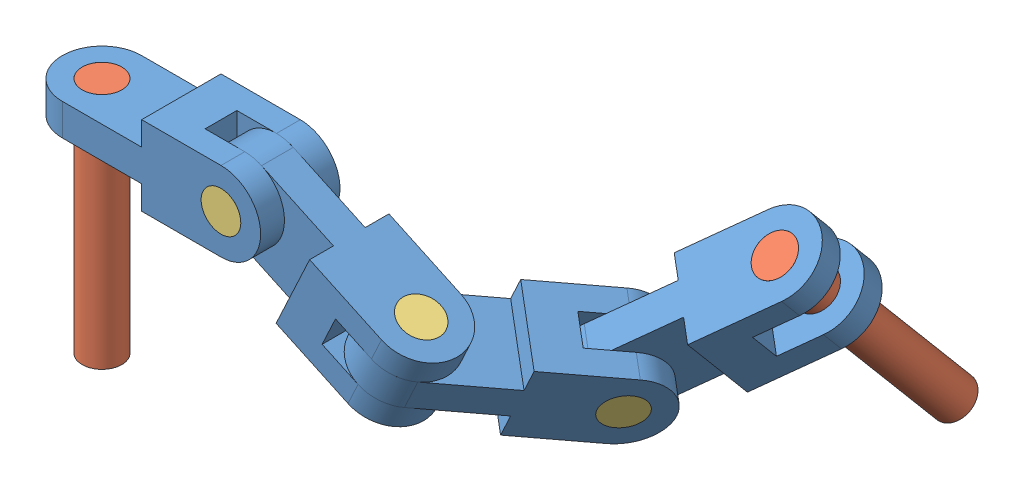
SolidWorks assembly Assemblage 1.SLDASM, configuration Default (file format 14000). Lengths in mm.
Overall size (743.15 346.45 520.78).
9 component instances, 3 part files, 22 mates.
Components (placement in the parent):
- chain_link-1: chain_link.SLDPRT [Default] at (551.0178 -99.1586 -216.4845) x (0.742404 -0.346189 0.573576) z (-0.126564 0.768256 0.627507) size (100 300 100)
- long_pin-1: long_pin.SLDPRT [Default] at origin size (50 300 50)
- short_pin-1: short_pin.SLDPRT [Default] at (200 -20 -50) x (1 0 0) z (0 1 0) size (50 100 50)
- chain_link-2: chain_link.SLDPRT [Default] at (100 -20 0) x (0 -1 0) z (0 0 1) size (100 300 100)
- chain_link-3: chain_link.SLDPRT [Default] at (290.6308 -62.2618 0) x (0 0 1) z (0.422618 0.906308 0) size (100 300 100)
- chain_link-4: chain_link.SLDPRT [Default] at (433.2452 -128.764 -81.9152) x (-0.422618 -0.906308 0) z (0.742404 -0.346189 0.573576) size (100 300 100)
- short_pin-2: short_pin.SLDPRT [Default] at (360.1306 -149.839 0) x (-0.491712 0.229289 -0.840027) z (-0.761323 0.355011 0.542544) size (50 100 50)
- short_pin-3: short_pin.SLDPRT [Default] at (448.1087 -135.695 -192.5092) x (-0.216703 0.686032 0.69455) z (-0.633937 -0.639932 0.434293) size (50 100 50)
- long_pin-2: long_pin.SLDPRT [Default] at (648.4478 -237.3768 -426.0153) x (0.958216 -0.068903 0.277624) z (0.256523 0.636424 -0.727434) size (50 300 50)
Mates (geometry in assembly coordinates):
- Coaxiale1: concentric aligned: cylinder of long_pin-1 through (0 -300 0) axis (0 1 0) radius 25
- Coïncidente1: coordinate: point of long_pin-1
- Coaxiale4: concentric anti-aligned: cylinder of long_pin-1 through (0 -300 0) axis (0 1 0) radius 25; cylinder of chain_link-2 through (0 30 0) axis (0 -1 0) radius 25
- Coïncidente6: coincident aligned: plane of long_pin-1 through (0 0 0) normal (0 1 0); plane of chain_link-2 through (0 0 0) normal (0 1 0)
- Parallèle2: parallel aligned: plane of chain_link-2 through (200 -20 50) normal (0 0 1)
- Coaxiale5: concentric anti-aligned: cylinder of short_pin-1 through (200 -20 50) axis (0 0 -1) radius 25; cylinder of chain_link-2 through (200 -20 -50) axis (0 0 1) radius 25
- Coïncidente8: coincident aligned: plane of short_pin-1 through (200 -20 50) normal (0 0 1); plane of chain_link-2 through (200 -20 50) normal (0 0 1)
- Coaxiale6: concentric anti-aligned: cylinder of short_pin-1 through (200 -20 50) axis (0 0 -1) radius 25; cylinder of chain_link-3 through (200 -20 -50) axis (0 0 1) radius 25
- Coïncidente9: coincident anti-aligned: plane of chain_link-2 through (250 30 20) normal (0 0 -1); plane of chain_link-3 through (200 -20 20) normal (0 0 1)
- Coaxiale7: concentric anti-aligned: cylinder of chain_link-3 through (360.1306 -149.839 0) axis (0.422618 0.906308 0) radius 25; cylinder of short_pin-2 through (402.3925 -59.2083 0) axis (-0.422618 -0.906308 0) radius 25
- Coïncidente10: coincident aligned: plane of chain_link-3 through (402.3925 -59.2083 0) normal (0.422618 0.906308 0); plane of short_pin-2 through (402.3925 -59.2083 0) normal (0.422618 0.906308 0)
- Coaxiale8: concentric aligned: cylinder of chain_link-4 through (402.3925 -59.2082 0) axis (-0.422618 -0.906308 0) radius 25; cylinder of short_pin-2 through (402.3925 -59.2083 0) axis (-0.422618 -0.906308 0) radius 25
- Coïncidente11: coincident anti-aligned: plane of chain_link-3 through (435.0293 -107.5284 -50) normal (-0.422618 -0.906308 0); plane of chain_link-4 through (389.7139 -86.3975 0) normal (0.422618 0.906308 0)
- Coaxiale9: concentric anti-aligned: cylinder of chain_link-4 through (448.1087 -135.695 -192.5092) axis (0.742404 -0.346189 0.573576) radius 25; cylinder of short_pin-3 through (522.3491 -170.3139 -135.1516) axis (-0.742404 0.346189 -0.573576) radius 25
- Coïncidente12: coincident aligned: plane of chain_link-4 through (522.3491 -170.3139 -135.1516) normal (0.742404 -0.346189 0.573576); plane of short_pin-3 through (522.3491 -170.3139 -135.1516) normal (0.742404 -0.346189 0.573576)
- Coaxiale10: concentric anti-aligned: cylinder of chain_link-1 through (448.1087 -135.695 -192.5092) axis (0.742404 -0.346189 0.573576) radius 25; cylinder of short_pin-3 through (522.3491 -170.3139 -135.1516) axis (-0.742404 0.346189 -0.573576) radius 25
- Coïncidente13: coincident anti-aligned: plane of chain_link-1 through (500.077 -159.9282 -152.3589) normal (0.742404 -0.346189 0.573576); plane of chain_link-4 through (547.1997 -126.733 -193.3165) normal (-0.742404 0.346189 -0.573576)
- Coaxiale11: concentric anti-aligned: cylinder of chain_link-1 through (623.1349 -83.7256 -300.5139) axis (-0.126564 0.768256 0.627507) radius 25; cylinder of long_pin-2 through (610.4785 -6.9001 -237.7632) axis (0.126564 -0.768256 -0.627507) radius 25
- Coïncidente14: coincident aligned: plane of chain_link-1 through (610.4785 -6.9001 -237.7632) normal (-0.126564 0.768256 0.627507); plane of long_pin-2 through (610.4785 -6.9001 -237.7632) normal (-0.126564 0.768256 0.627507)
- Angle1: planar angle = 0.436332 rad aligned: plane of chain_link-2 through (100 30 50) normal (0 1 0); plane of chain_link-3 through (402.3925 -59.2083 0) normal (0.422618 0.906308 0)
- Angle2: planar angle = 2.181662 rad anti-aligned: plane of chain_link-3 through (311.7617 -16.9464 -50) normal (0 0 -1); plane of chain_link-4 through (448.1087 -135.695 -192.5092) normal (-0.742404 0.346189 -0.573576)
- Angle3: planar angle = 2.268928 rad anti-aligned: plane of chain_link-4 through (491.4963 -100.7581 -53.2364) normal (0.422618 0.906308 0); plane of chain_link-1 through (610.4785 -6.9001 -237.7632) normal (-0.126564 0.768256 0.627507)
